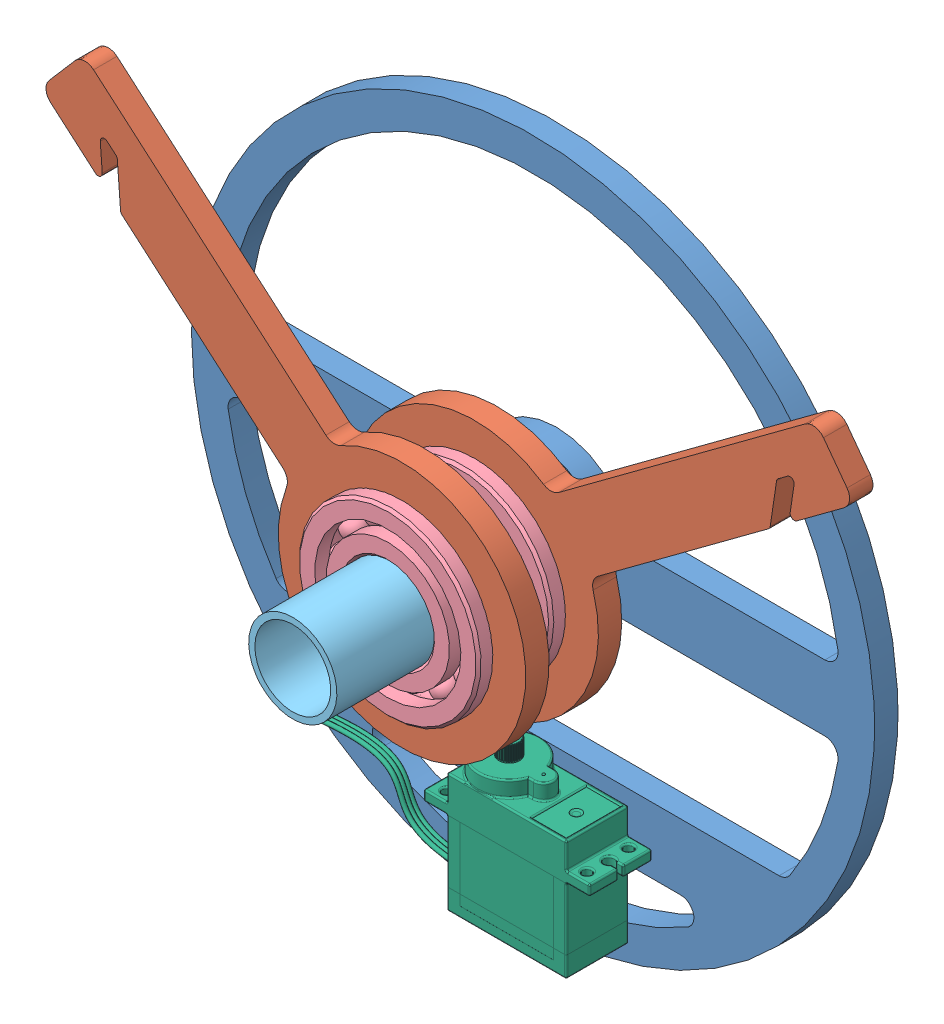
SolidWorks assembly Gondola.SLDASM, configuration Default (file format 8000). Lengths in mm.
Overall size (164.77 140.36 50.8).
9 component instances, 6 part files, 12 mates.
Components (placement in the parent):
- Balance Plate-1: Balance Plate.SLDPRT [Default] at (27.4156 60.7174 111.808) size (131.65 131.65 4.5)
- Bearing Holder-1: Bearing Holder.SLDPRT [Default] at (27.4156 60.7174 141.558) x (-0.757382 0.652972 0) z (0 0 -1) size (110.34 47.7 4.5)
- Bearing Spacer-1: Bearing Spacer.SLDPRT [Default] at (27.4156 60.7174 134.308) x (0.458274 -0.888811 0) z (0 0 -1) size (25.4 25.4 4.5)
- 5972K311-1: 5972K311.SLDPRT [5972K311] at (27.4156 60.7174 125.308) size (35 35 10)
- 5972K311-2: 5972K311.SLDPRT [5972K311] at (27.4156 60.7174 139.308) x (-0.857548 0.514404 0) z (0 0 -1) size (35 35 10)
- Bearing Spacer-2: Bearing Spacer.SLDPRT [Default] at (27.4156 60.7174 116.308) x (-0.912005 0.41018 0) z (0 0 1) size (25.4 25.4 4.5)
- Bearing Holder-2: Bearing Holder.SLDPRT [Default] at (27.4156 60.7174 123.058) x (0.803469 0.595346 0) z (0 0 1) size (110.34 47.7 4.5)
- Pen Shaft-1: Pen Shaft.SLDPRT [Default] at (27.4156 60.7174 111.808) x (-0.790099 -0.612979 0) z (0 0 1) size (17 17 50.8)
- Servo HXT900 Micro-1: Servo HXT900 Micro.SLDPRT [Valor predeterminado] at (34.3146 0.8328 122.308) size (56.55 29.01 12.2)
Mates (geometry in assembly coordinates):
- Concentric1: concentric aligned: circle of Bearing Spacer-1; circle of 5972K311-2
- Concentric2: concentric anti-aligned: cylinder of Bearing Spacer-1 through (27.4156 60.7174 129.808) axis (0 0 1) radius 12.7; circle of 5972K311-2
- Coincident1: coincident anti-aligned: plane of Bearing Spacer-1 through (27.4156 60.7174 134.308) normal (0 0 1); plane of 5972K311-2 through (33.5376 70.9231 134.308) normal (0 0 -1)
- Coincident3: coincident aligned: circle of 5972K311-1; circle of Bearing Spacer-2
- Coincident4: coincident anti-aligned: circle of Bearing Spacer-1; circle of 5972K311-1
- Coincident9: coincident aligned: circle of Balance Plate-1; circle of Pen Shaft-1
- Coincident10: coincident aligned: circle of Balance Plate-1; circle of Bearing Spacer-2
- Coincident11: coincident anti-aligned: plane of Balance Plate-1 through (27.4156 60.7174 116.308) normal (0 0 1); plane of Servo HXT900 Micro-1 through (45.8146 23.8328 116.308) normal (0 0 -1)
- Concentric8: concentric anti-aligned: cylinder of 5972K311-1 through (27.4156 60.7174 130.308) axis (0 0 1) radius 17.5; cylinder of Bearing Holder-2 through (27.4156 60.7174 127.558) axis (0 0 -1) radius 17.5
- Distance4: distance = 2.75 mm aligned: plane of Bearing Holder-2 through (27.4156 60.7174 127.558) normal (0 0 1); plane of 5972K311-1 through (27.4156 77.7174 130.308) normal (0 0 1)
- Concentric9: concentric anti-aligned: cylinder of Bearing Holder-1 through (27.4156 60.7174 137.058) axis (0 0 1) radius 17.5; cylinder of 5972K311-2 through (27.4156 60.7174 134.308) axis (0 0 -1) radius 17.5
- Distance5: distance = 2.75 mm aligned: plane of Bearing Holder-1 through (27.4156 60.7174 141.558) normal (0 0 1); plane of 5972K311-2 through (36.1605 75.2957 144.308) normal (0 0 1)
